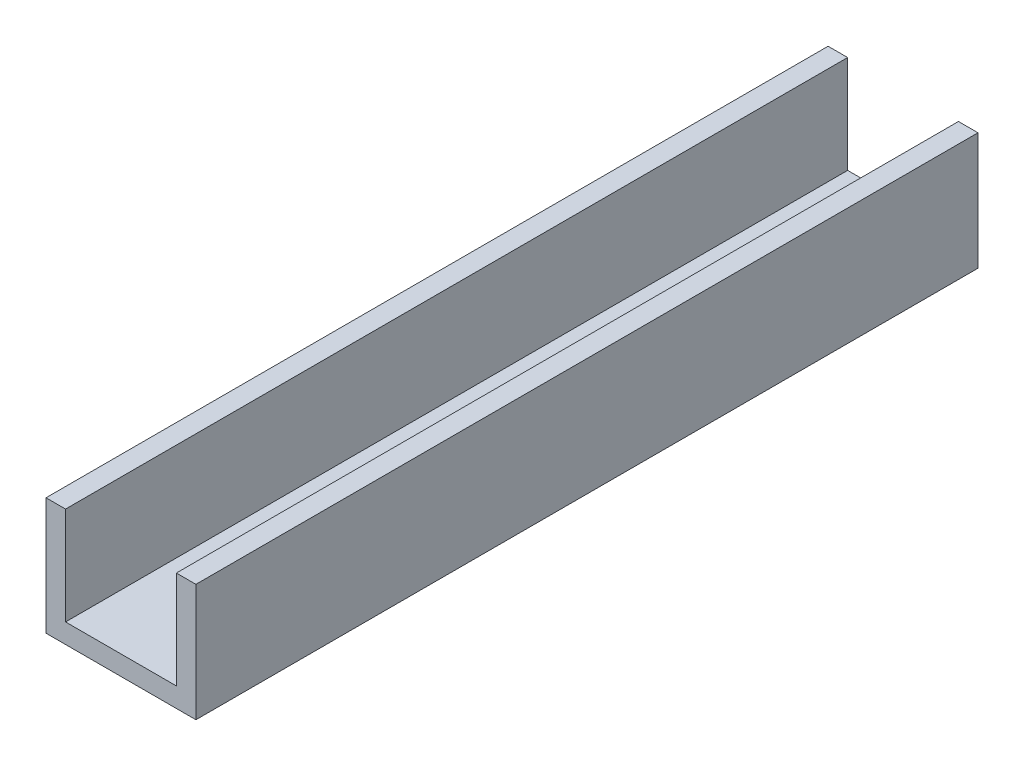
from build123d import *

# Parameters (mm, degrees)
BOSS_EXTRUDE1_DEPTH = 120
SKETCH2_R           = 1.5
CUT_EXTRUDE1_DEPTH  = 1


with BuildPart() as part:
    # Sketch1 → Boss-Extrude1 (new body)
    with BuildSketch(Plane.XY):
        Polygon((8.5, 7.5), (11.5, 7.5), (11.5, -10.5), (-11.5, -10.5), (-11.5, 7.5), (-8.5, 7.5), (-8.5, -7.5), (8.5, -7.5), align=None)
    extrude(amount=BOSS_EXTRUDE1_DEPTH)

    # Sketch2 → Cut-Extrude1 (cut)
    with BuildSketch(Plane.XZ.offset(10.5)):
        with Locations((0, 20)):
            Circle(SKETCH2_R)
        with Locations((0, 35)):
            Circle(SKETCH2_R)
    extrude(amount=-CUT_EXTRUDE1_DEPTH, mode=Mode.SUBTRACT)


solid = part.part
